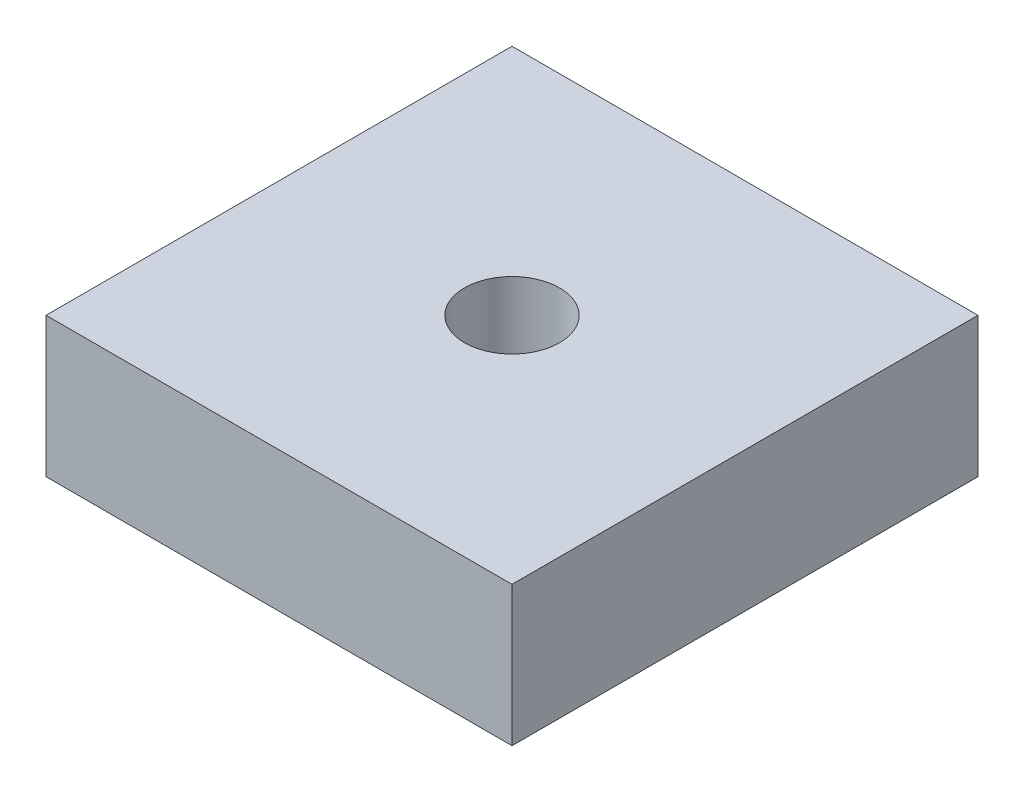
from build123d import *

# Parameters (mm, degrees)
ESQUISSE1_W        = 50
ESQUISSE1_H        = 50
EXTRUSION1_DEPTH   = 15
TROU_TARAUD_M121_D = 10.2


with BuildPart() as part:
    # Esquisse1 → Extrusion1 (new body)
    with BuildSketch(Plane(origin=(0, 0, 0), x_dir=(1, 0, 0), z_dir=(0, 1, 0))):
        Rectangle(ESQUISSE1_W, ESQUISSE1_H)
    extrude(amount=EXTRUSION1_DEPTH)

    # Trou taraud_ M121 (through all)
    with Locations(Plane(origin=(0, 15, 0), x_dir=(-1, 0, 0), z_dir=(0, 1, 0))):
        with Locations((0, 0)):
            Hole(TROU_TARAUD_M121_D / 2)


solid = part.part
